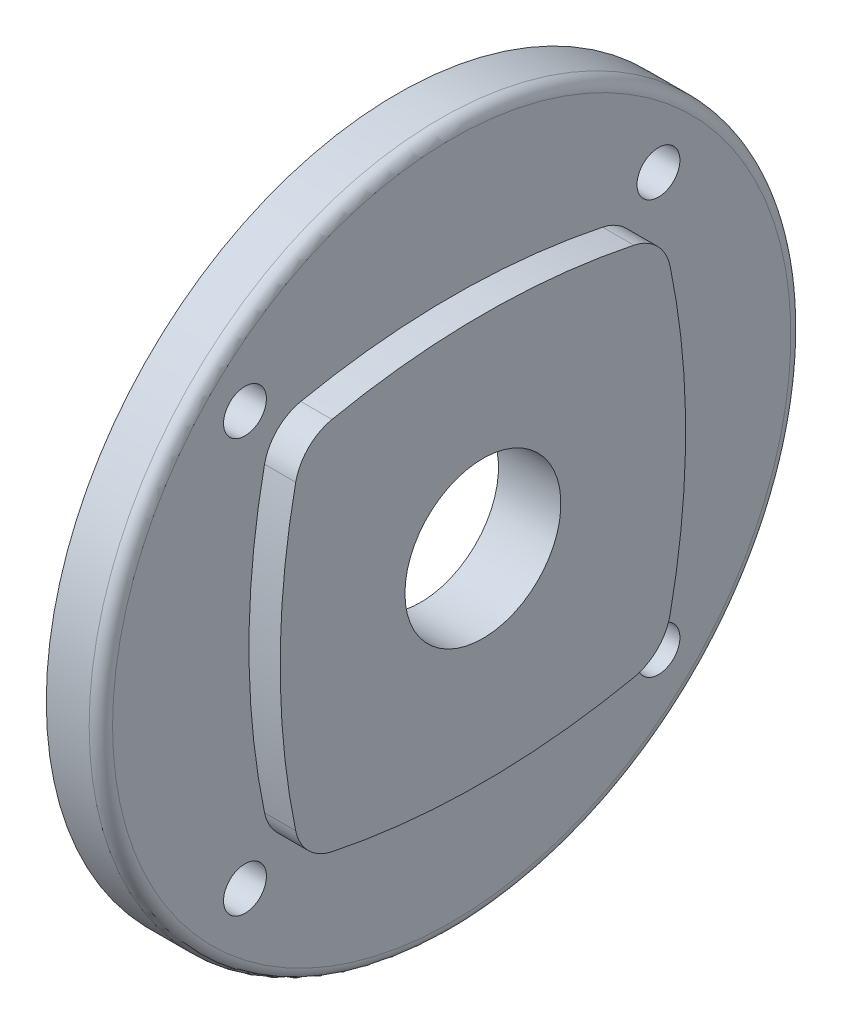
ISO-10303-21;
HEADER;
FILE_DESCRIPTION(('STEP AP214'),'2;1');
FILE_NAME('part.step','',(''),(''),'','','');
FILE_SCHEMA(('AUTOMOTIVE_DESIGN { 1 0 10303 214 1 1 1 1 }'));
ENDSEC;
DATA;
#1=APPLICATION_CONTEXT('core data for automotive mechanical design processes');
#2=APPLICATION_PROTOCOL_DEFINITION('international standard','automotive_design',2000,#1);
#3=PRODUCT_CONTEXT('',#1,'mechanical');
#4=PRODUCT('Part','Part','',(#3));
#5=PRODUCT_RELATED_PRODUCT_CATEGORY('part','',(#4));
#6=PRODUCT_DEFINITION_FORMATION('','',#4);
#7=PRODUCT_DEFINITION_CONTEXT('part definition',#1,'design');
#8=PRODUCT_DEFINITION('design','',#6,#7);
#9=PRODUCT_DEFINITION_SHAPE('','',#8);
#10=(LENGTH_UNIT() NAMED_UNIT(*) SI_UNIT(.MILLI.,.METRE.));
#11=(NAMED_UNIT(*) PLANE_ANGLE_UNIT() SI_UNIT($,.RADIAN.));
#12=(NAMED_UNIT(*) SI_UNIT($,.STERADIAN.) SOLID_ANGLE_UNIT());
#13=UNCERTAINTY_MEASURE_WITH_UNIT(LENGTH_MEASURE(1.E-05),#10,'distance_accuracy_value','');
#14=(GEOMETRIC_REPRESENTATION_CONTEXT(3) GLOBAL_UNCERTAINTY_ASSIGNED_CONTEXT((#13)) GLOBAL_UNIT_ASSIGNED_CONTEXT((#10,
#11,#12)) REPRESENTATION_CONTEXT('',''));
#15=CARTESIAN_POINT('',(0.,0.,0.));
#16=DIRECTION('',(0.,0.,1.));
#17=DIRECTION('',(1.,0.,0.));
#18=AXIS2_PLACEMENT_3D('',#15,#16,#17);
#19=CARTESIAN_POINT('',(11.,0.,0.));
#20=DIRECTION('',(-1.,0.,0.));
#21=DIRECTION('',(0.,0.,1.));
#22=AXIS2_PLACEMENT_3D('',#19,#20,#21);
#23=CYLINDRICAL_SURFACE('',#22,10.);
#24=CARTESIAN_POINT('',(11.,0.,0.));
#25=DIRECTION('',(-1.,0.,0.));
#26=DIRECTION('',(0.,0.,1.));
#27=AXIS2_PLACEMENT_3D('',#24,#25,#26);
#28=CIRCLE('',#27,10.);
#29=CARTESIAN_POINT('',(11.,0.,10.));
#30=VERTEX_POINT('',#29);
#31=EDGE_CURVE('E20',#30,#30,#28,.F.);
#32=ORIENTED_EDGE('',*,*,#31,.T.);
#33=EDGE_LOOP('',(#32));
#34=FACE_BOUND('',#33,.T.);
#35=CARTESIAN_POINT('',(3.,0.,0.));
#36=DIRECTION('',(-1.,0.,0.));
#37=DIRECTION('',(0.,0.,1.));
#38=AXIS2_PLACEMENT_3D('',#35,#36,#37);
#39=CIRCLE('',#38,10.);
#40=CARTESIAN_POINT('',(3.,0.,10.));
#41=VERTEX_POINT('',#40);
#42=EDGE_CURVE('E91',#41,#41,#39,.T.);
#43=ORIENTED_EDGE('',*,*,#42,.T.);
#44=EDGE_LOOP('',(#43));
#45=FACE_BOUND('',#44,.T.);
#46=ADVANCED_FACE('F16',(#34,#45),#23,.F.);
#47=CARTESIAN_POINT('',(11.,-26.312,-26.312));
#48=DIRECTION('',(-1.,0.,0.));
#49=DIRECTION('',(0.,0.,1.));
#50=AXIS2_PLACEMENT_3D('',#47,#48,#49);
#51=PLANE('',#50);
#52=ORIENTED_EDGE('',*,*,#31,.F.);
#53=EDGE_LOOP('',(#52));
#54=FACE_BOUND('',#53,.T.);
#55=CARTESIAN_POINT('',(11.,-18.1331644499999,-18.1331644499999));
#56=DIRECTION('',(1.,0.,0.));
#57=DIRECTION('',(0.,1.,0.));
#58=AXIS2_PLACEMENT_3D('',#55,#56,#57);
#59=CIRCLE('',#58,6.);
#60=CARTESIAN_POINT('',(11.,-24.0073103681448,-19.3556249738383));
#61=VERTEX_POINT('',#60);
#62=CARTESIAN_POINT('',(11.,-19.3556249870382,-24.0073103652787));
#63=VERTEX_POINT('',#62);
#64=EDGE_CURVE('E114',#61,#63,#59,.T.);
#65=ORIENTED_EDGE('',*,*,#64,.T.);
#66=CARTESIAN_POINT('',(11.,0.,69.));
#67=DIRECTION('',(1.,0.,0.));
#68=DIRECTION('',(0.,1.,0.));
#69=AXIS2_PLACEMENT_3D('',#66,#67,#68);
#70=CIRCLE('',#69,95.);
#71=CARTESIAN_POINT('',(11.,19.3556249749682,-24.0073103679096));
#72=VERTEX_POINT('',#71);
#73=EDGE_CURVE('E101',#63,#72,#70,.T.);
#74=ORIENTED_EDGE('',*,*,#73,.T.);
#75=CARTESIAN_POINT('',(11.,18.13316445,-18.1331644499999));
#76=DIRECTION('',(1.,0.,0.));
#77=DIRECTION('',(0.,1.,0.));
#78=AXIS2_PLACEMENT_3D('',#75,#76,#77);
#79=CIRCLE('',#78,6.);
#80=CARTESIAN_POINT('',(11.,24.0073103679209,-19.355624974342));
#81=VERTEX_POINT('',#80);
#82=EDGE_CURVE('E94',#72,#81,#79,.T.);
#83=ORIENTED_EDGE('',*,*,#82,.T.);
#84=CARTESIAN_POINT('',(11.,-69.,0.));
#85=DIRECTION('',(1.,0.,0.));
#86=DIRECTION('',(0.,1.,0.));
#87=AXIS2_PLACEMENT_3D('',#84,#85,#86);
#88=CIRCLE('',#87,95.);
#89=CARTESIAN_POINT('',(11.,24.0073103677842,19.3556249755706));
#90=VERTEX_POINT('',#89);
#91=EDGE_CURVE('E81',#81,#90,#88,.T.);
#92=ORIENTED_EDGE('',*,*,#91,.T.);
#93=CARTESIAN_POINT('',(11.,18.1331644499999,18.13316445));
#94=DIRECTION('',(1.,0.,0.));
#95=DIRECTION('',(0.,1.,0.));
#96=AXIS2_PLACEMENT_3D('',#93,#94,#95);
#97=CIRCLE('',#96,6.);
#98=CARTESIAN_POINT('',(11.,19.3556249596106,24.0073103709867));
#99=VERTEX_POINT('',#98);
#100=EDGE_CURVE('E90',#90,#99,#97,.T.);
#101=ORIENTED_EDGE('',*,*,#100,.T.);
#102=CARTESIAN_POINT('',(11.,0.,-69.));
#103=DIRECTION('',(1.,0.,0.));
#104=DIRECTION('',(0.,1.,0.));
#105=AXIS2_PLACEMENT_3D('',#102,#103,#104);
#106=CIRCLE('',#105,95.);
#107=CARTESIAN_POINT('',(11.,-19.355624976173,24.007310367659));
#108=VERTEX_POINT('',#107);
#109=EDGE_CURVE('E127',#99,#108,#106,.T.);
#110=ORIENTED_EDGE('',*,*,#109,.T.);
#111=CARTESIAN_POINT('',(11.,-18.13316445,18.1331644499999));
#112=DIRECTION('',(1.,0.,0.));
#113=DIRECTION('',(0.,1.,0.));
#114=AXIS2_PLACEMENT_3D('',#111,#112,#113);
#115=CIRCLE('',#114,6.);
#116=CARTESIAN_POINT('',(11.,-24.0073103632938,19.3556249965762));
#117=VERTEX_POINT('',#116);
#118=EDGE_CURVE('E123',#108,#117,#115,.T.);
#119=ORIENTED_EDGE('',*,*,#118,.T.);
#120=CARTESIAN_POINT('',(11.,69.,0.));
#121=DIRECTION('',(1.,0.,0.));
#122=DIRECTION('',(0.,1.,0.));
#123=AXIS2_PLACEMENT_3D('',#120,#121,#122);
#124=CIRCLE('',#123,95.);
#125=EDGE_CURVE('E118',#117,#61,#124,.T.);
#126=ORIENTED_EDGE('',*,*,#125,.T.);
#127=EDGE_LOOP('',(#65,#74,#83,#92,#101,#110,#119,#126));
#128=FACE_BOUND('',#127,.T.);
#129=ADVANCED_FACE('F100',(#54,#128),#51,.F.);
#130=CARTESIAN_POINT('',(3.,-30.36,30.36));
#131=DIRECTION('',(1.,0.,0.));
#132=DIRECTION('',(0.,0.,-1.));
#133=AXIS2_PLACEMENT_3D('',#130,#131,#132);
#134=PLANE('',#133);
#135=ORIENTED_EDGE('',*,*,#42,.F.);
#136=EDGE_LOOP('',(#135));
#137=FACE_BOUND('',#136,.T.);
#138=CARTESIAN_POINT('',(3.,0.,0.));
#139=DIRECTION('',(-1.,0.,0.));
#140=DIRECTION('',(0.,0.,1.));
#141=AXIS2_PLACEMENT_3D('',#138,#139,#140);
#142=CIRCLE('',#141,30.);
#143=CARTESIAN_POINT('',(3.,0.,30.));
#144=VERTEX_POINT('',#143);
#145=EDGE_CURVE('E111',#144,#144,#142,.F.);
#146=ORIENTED_EDGE('',*,*,#145,.F.);
#147=EDGE_LOOP('',(#146));
#148=FACE_BOUND('',#147,.T.);
#149=ADVANCED_FACE('F145',(#137,#148),#134,.F.);
#150=CARTESIAN_POINT('',(5.5,0.,0.));
#151=DIRECTION('',(-1.,0.,0.));
#152=DIRECTION('',(0.,0.,1.));
#153=AXIS2_PLACEMENT_3D('',#150,#151,#152);
#154=TOROIDAL_SURFACE('',#153,43.5,1.5);
#155=CARTESIAN_POINT('',(5.5,0.,0.));
#156=DIRECTION('',(-1.,0.,0.));
#157=DIRECTION('',(0.,0.,1.));
#158=AXIS2_PLACEMENT_3D('',#155,#156,#157);
#159=CIRCLE('',#158,45.);
#160=CARTESIAN_POINT('',(5.5,0.,45.));
#161=VERTEX_POINT('',#160);
#162=EDGE_CURVE('E256',#161,#161,#159,.F.);
#163=ORIENTED_EDGE('',*,*,#162,.T.);
#164=EDGE_LOOP('',(#163));
#165=FACE_BOUND('',#164,.T.);
#166=CARTESIAN_POINT('',(7.,0.,0.));
#167=DIRECTION('',(-1.,0.,0.));
#168=DIRECTION('',(0.,0.,1.));
#169=AXIS2_PLACEMENT_3D('',#166,#167,#168);
#170=CIRCLE('',#169,43.499999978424);
#171=CARTESIAN_POINT('',(7.,0.,43.499999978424));
#172=VERTEX_POINT('',#171);
#173=EDGE_CURVE('E249',#172,#172,#170,.T.);
#174=ORIENTED_EDGE('',*,*,#173,.T.);
#175=EDGE_LOOP('',(#174));
#176=FACE_BOUND('',#175,.T.);
#177=ADVANCED_FACE('F152',(#165,#176),#154,.T.);
#178=CARTESIAN_POINT('',(7.,-69.,0.));
#179=DIRECTION('',(1.,0.,0.));
#180=DIRECTION('',(0.,1.,0.));
#181=AXIS2_PLACEMENT_3D('',#178,#179,#180);
#182=CYLINDRICAL_SURFACE('',#181,95.);
#183=ORIENTED_EDGE('',*,*,#91,.F.);
#184=DIRECTION('',(1.,0.,0.));
#185=VECTOR('',#184,1.);
#186=CARTESIAN_POINT('',(9.,24.0073103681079,-19.3556249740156));
#187=LINE('',#186,#185);
#188=CARTESIAN_POINT('',(7.,24.0073103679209,-19.355624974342));
#189=VERTEX_POINT('',#188);
#190=EDGE_CURVE('E85',#81,#189,#187,.F.);
#191=ORIENTED_EDGE('',*,*,#190,.T.);
#192=CARTESIAN_POINT('',(7.,-69.,0.));
#193=DIRECTION('',(1.,0.,0.));
#194=DIRECTION('',(0.,1.,0.));
#195=AXIS2_PLACEMENT_3D('',#192,#193,#194);
#196=CIRCLE('',#195,95.);
#197=CARTESIAN_POINT('',(7.,24.0073103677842,19.3556249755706));
#198=VERTEX_POINT('',#197);
#199=EDGE_CURVE('E262',#189,#198,#196,.T.);
#200=ORIENTED_EDGE('',*,*,#199,.T.);
#201=DIRECTION('',(-1.,0.,0.));
#202=VECTOR('',#201,1.);
#203=CARTESIAN_POINT('',(9.,24.0073103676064,19.3556249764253));
#204=LINE('',#203,#202);
#205=EDGE_CURVE('E86',#198,#90,#204,.F.);
#206=ORIENTED_EDGE('',*,*,#205,.T.);
#207=EDGE_LOOP('',(#183,#191,#200,#206));
#208=FACE_BOUND('',#207,.T.);
#209=ADVANCED_FACE('F83',(#208),#182,.T.);
#210=CARTESIAN_POINT('',(7.,18.1331644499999,18.13316445));
#211=DIRECTION('',(1.,0.,0.));
#212=DIRECTION('',(0.,1.,0.));
#213=AXIS2_PLACEMENT_3D('',#210,#211,#212);
#214=CYLINDRICAL_SURFACE('',#213,6.);
#215=CARTESIAN_POINT('',(7.,18.1331644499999,18.13316445));
#216=DIRECTION('',(1.,0.,0.));
#217=DIRECTION('',(0.,1.,0.));
#218=AXIS2_PLACEMENT_3D('',#215,#216,#217);
#219=CIRCLE('',#218,6.);
#220=CARTESIAN_POINT('',(7.,19.3556249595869,24.0073103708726));
#221=VERTEX_POINT('',#220);
#222=EDGE_CURVE('E264',#198,#221,#219,.T.);
#223=ORIENTED_EDGE('',*,*,#222,.T.);
#224=DIRECTION('',(-1.,0.,0.));
#225=VECTOR('',#224,1.);
#226=CARTESIAN_POINT('',(9.,19.3556249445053,24.0073103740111));
#227=LINE('',#226,#225);
#228=EDGE_CURVE('E131',#221,#99,#227,.F.);
#229=ORIENTED_EDGE('',*,*,#228,.T.);
#230=ORIENTED_EDGE('',*,*,#100,.F.);
#231=ORIENTED_EDGE('',*,*,#205,.F.);
#232=EDGE_LOOP('',(#223,#229,#230,#231));
#233=FACE_BOUND('',#232,.T.);
#234=ADVANCED_FACE('F208',(#233),#214,.T.);
#235=CARTESIAN_POINT('',(7.,0.,-69.));
#236=DIRECTION('',(1.,0.,0.));
#237=DIRECTION('',(0.,1.,0.));
#238=AXIS2_PLACEMENT_3D('',#235,#236,#237);
#239=CYLINDRICAL_SURFACE('',#238,95.);
#240=ORIENTED_EDGE('',*,*,#109,.F.);
#241=ORIENTED_EDGE('',*,*,#228,.F.);
#242=CARTESIAN_POINT('',(7.,0.,-69.));
#243=DIRECTION('',(1.,0.,0.));
#244=DIRECTION('',(0.,1.,0.));
#245=AXIS2_PLACEMENT_3D('',#242,#243,#244);
#246=CIRCLE('',#245,95.);
#247=CARTESIAN_POINT('',(7.,-19.355624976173,24.007310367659));
#248=VERTEX_POINT('',#247);
#249=EDGE_CURVE('E268',#221,#248,#246,.T.);
#250=ORIENTED_EDGE('',*,*,#249,.T.);
#251=DIRECTION('',(-1.,0.,0.));
#252=VECTOR('',#251,1.);
#253=CARTESIAN_POINT('',(9.,-19.35562497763,24.0073103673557));
#254=LINE('',#253,#252);
#255=EDGE_CURVE('E126',#248,#108,#254,.F.);
#256=ORIENTED_EDGE('',*,*,#255,.T.);
#257=EDGE_LOOP('',(#240,#241,#250,#256));
#258=FACE_BOUND('',#257,.T.);
#259=ADVANCED_FACE('F204',(#258),#239,.T.);
#260=CARTESIAN_POINT('',(7.,-18.13316445,18.1331644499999));
#261=DIRECTION('',(1.,0.,0.));
#262=DIRECTION('',(0.,1.,0.));
#263=AXIS2_PLACEMENT_3D('',#260,#261,#262);
#264=CYLINDRICAL_SURFACE('',#263,6.);
#265=CARTESIAN_POINT('',(7.,-18.13316445,18.1331644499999));
#266=DIRECTION('',(1.,0.,0.));
#267=DIRECTION('',(0.,1.,0.));
#268=AXIS2_PLACEMENT_3D('',#265,#266,#267);
#269=CIRCLE('',#268,6.);
#270=CARTESIAN_POINT('',(7.,-24.0073103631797,19.3556249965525));
#271=VERTEX_POINT('',#270);
#272=EDGE_CURVE('E271',#248,#271,#269,.T.);
#273=ORIENTED_EDGE('',*,*,#272,.T.);
#274=DIRECTION('',(-1.,0.,0.));
#275=VECTOR('',#274,1.);
#276=CARTESIAN_POINT('',(9.,-24.0073103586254,19.3556250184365));
#277=LINE('',#276,#275);
#278=EDGE_CURVE('E122',#271,#117,#277,.F.);
#279=ORIENTED_EDGE('',*,*,#278,.T.);
#280=ORIENTED_EDGE('',*,*,#118,.F.);
#281=ORIENTED_EDGE('',*,*,#255,.F.);
#282=EDGE_LOOP('',(#273,#279,#280,#281));
#283=FACE_BOUND('',#282,.T.);
#284=ADVANCED_FACE('F200',(#283),#264,.T.);
#285=CARTESIAN_POINT('',(7.,69.,0.));
#286=DIRECTION('',(1.,0.,0.));
#287=DIRECTION('',(0.,1.,0.));
#288=AXIS2_PLACEMENT_3D('',#285,#286,#287);
#289=CYLINDRICAL_SURFACE('',#288,95.);
#290=ORIENTED_EDGE('',*,*,#125,.F.);
#291=ORIENTED_EDGE('',*,*,#278,.F.);
#292=CARTESIAN_POINT('',(7.,69.,0.));
#293=DIRECTION('',(1.,0.,0.));
#294=DIRECTION('',(0.,1.,0.));
#295=AXIS2_PLACEMENT_3D('',#292,#293,#294);
#296=CIRCLE('',#295,95.);
#297=CARTESIAN_POINT('',(7.,-24.0073103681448,-19.3556249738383));
#298=VERTEX_POINT('',#297);
#299=EDGE_CURVE('E275',#271,#298,#296,.T.);
#300=ORIENTED_EDGE('',*,*,#299,.T.);
#301=DIRECTION('',(-1.,0.,0.));
#302=VECTOR('',#301,1.);
#303=CARTESIAN_POINT('',(9.,-24.0073103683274,-19.3556249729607));
#304=LINE('',#303,#302);
#305=EDGE_CURVE('E117',#298,#61,#304,.F.);
#306=ORIENTED_EDGE('',*,*,#305,.T.);
#307=EDGE_LOOP('',(#290,#291,#300,#306));
#308=FACE_BOUND('',#307,.T.);
#309=ADVANCED_FACE('F196',(#308),#289,.T.);
#310=CARTESIAN_POINT('',(7.,-18.1331644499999,-18.1331644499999));
#311=DIRECTION('',(1.,0.,0.));
#312=DIRECTION('',(0.,1.,0.));
#313=AXIS2_PLACEMENT_3D('',#310,#311,#312);
#314=CYLINDRICAL_SURFACE('',#313,6.);
#315=CARTESIAN_POINT('',(7.,-18.1331644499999,-18.1331644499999));
#316=DIRECTION('',(1.,0.,0.));
#317=DIRECTION('',(0.,1.,0.));
#318=AXIS2_PLACEMENT_3D('',#315,#316,#317);
#319=CIRCLE('',#318,6.);
#320=CARTESIAN_POINT('',(7.,-19.3556249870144,-24.0073103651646));
#321=VERTEX_POINT('',#320);
#322=EDGE_CURVE('E279',#298,#321,#319,.T.);
#323=ORIENTED_EDGE('',*,*,#322,.T.);
#324=DIRECTION('',(-1.,0.,0.));
#325=VECTOR('',#324,1.);
#326=CARTESIAN_POINT('',(9.,-19.3556249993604,-24.0073103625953));
#327=LINE('',#326,#325);
#328=EDGE_CURVE('E108',#321,#63,#327,.F.);
#329=ORIENTED_EDGE('',*,*,#328,.T.);
#330=ORIENTED_EDGE('',*,*,#64,.F.);
#331=ORIENTED_EDGE('',*,*,#305,.F.);
#332=EDGE_LOOP('',(#323,#329,#330,#331));
#333=FACE_BOUND('',#332,.T.);
#334=ADVANCED_FACE('F192',(#333),#314,.T.);
#335=CARTESIAN_POINT('',(7.,0.,69.));
#336=DIRECTION('',(1.,0.,0.));
#337=DIRECTION('',(0.,1.,0.));
#338=AXIS2_PLACEMENT_3D('',#335,#336,#337);
#339=CYLINDRICAL_SURFACE('',#338,95.);
#340=CARTESIAN_POINT('',(7.,0.,69.));
#341=DIRECTION('',(1.,0.,0.));
#342=DIRECTION('',(0.,1.,0.));
#343=AXIS2_PLACEMENT_3D('',#340,#341,#342);
#344=CIRCLE('',#343,95.);
#345=CARTESIAN_POINT('',(7.,19.3556249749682,-24.0073103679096));
#346=VERTEX_POINT('',#345);
#347=EDGE_CURVE('E230',#321,#346,#344,.T.);
#348=ORIENTED_EDGE('',*,*,#347,.T.);
#349=DIRECTION('',(-1.,0.,0.));
#350=VECTOR('',#349,1.);
#351=CARTESIAN_POINT('',(9.,19.3556249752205,-24.0073103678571));
#352=LINE('',#351,#350);
#353=EDGE_CURVE('E36',#346,#72,#352,.F.);
#354=ORIENTED_EDGE('',*,*,#353,.T.);
#355=ORIENTED_EDGE('',*,*,#73,.F.);
#356=ORIENTED_EDGE('',*,*,#328,.F.);
#357=EDGE_LOOP('',(#348,#354,#355,#356));
#358=FACE_BOUND('',#357,.T.);
#359=ADVANCED_FACE('F189',(#358),#339,.T.);
#360=CARTESIAN_POINT('',(7.,18.13316445,-18.1331644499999));
#361=DIRECTION('',(1.,0.,0.));
#362=DIRECTION('',(0.,1.,0.));
#363=AXIS2_PLACEMENT_3D('',#360,#361,#362);
#364=CYLINDRICAL_SURFACE('',#363,6.);
#365=CARTESIAN_POINT('',(7.,18.13316445,-18.1331644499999));
#366=DIRECTION('',(1.,0.,0.));
#367=DIRECTION('',(0.,1.,0.));
#368=AXIS2_PLACEMENT_3D('',#365,#366,#367);
#369=CIRCLE('',#368,6.);
#370=EDGE_CURVE('E96',#346,#189,#369,.T.);
#371=ORIENTED_EDGE('',*,*,#370,.T.);
#372=ORIENTED_EDGE('',*,*,#190,.F.);
#373=ORIENTED_EDGE('',*,*,#82,.F.);
#374=ORIENTED_EDGE('',*,*,#353,.F.);
#375=EDGE_LOOP('',(#371,#372,#373,#374));
#376=FACE_BOUND('',#375,.T.);
#377=ADVANCED_FACE('F93',(#376),#364,.T.);
#378=CARTESIAN_POINT('',(5.5,0.,0.));
#379=DIRECTION('',(-1.,0.,0.));
#380=DIRECTION('',(0.,0.,1.));
#381=AXIS2_PLACEMENT_3D('',#378,#379,#380);
#382=CYLINDRICAL_SURFACE('',#381,45.);
#383=CARTESIAN_POINT('',(0.,0.,0.));
#384=DIRECTION('',(-1.,0.,0.));
#385=DIRECTION('',(0.,0.,1.));
#386=AXIS2_PLACEMENT_3D('',#383,#384,#385);
#387=CIRCLE('',#386,45.);
#388=CARTESIAN_POINT('',(0.,0.,45.));
#389=VERTEX_POINT('',#388);
#390=EDGE_CURVE('E286',#389,#389,#387,.F.);
#391=ORIENTED_EDGE('',*,*,#390,.T.);
#392=EDGE_LOOP('',(#391));
#393=FACE_BOUND('',#392,.T.);
#394=ORIENTED_EDGE('',*,*,#162,.F.);
#395=EDGE_LOOP('',(#394));
#396=FACE_BOUND('',#395,.T.);
#397=ADVANCED_FACE('F182',(#393,#396),#382,.T.);
#398=CARTESIAN_POINT('',(7.,-26.516504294,26.516504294));
#399=DIRECTION('',(-1.,0.,0.));
#400=DIRECTION('',(0.,-1.,0.));
#401=AXIS2_PLACEMENT_3D('',#398,#399,#400);
#402=CYLINDRICAL_SURFACE('',#401,2.75);
#403=CARTESIAN_POINT('',(7.,-26.516504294,26.516504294));
#404=DIRECTION('',(-1.,0.,0.));
#405=DIRECTION('',(0.,-1.,0.));
#406=AXIS2_PLACEMENT_3D('',#403,#404,#405);
#407=CIRCLE('',#406,2.75);
#408=CARTESIAN_POINT('',(7.,-29.266504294,26.516504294));
#409=VERTEX_POINT('',#408);
#410=EDGE_CURVE('E243',#409,#409,#407,.F.);
#411=ORIENTED_EDGE('',*,*,#410,.T.);
#412=EDGE_LOOP('',(#411));
#413=FACE_BOUND('',#412,.T.);
#414=CARTESIAN_POINT('',(0.,-26.516504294,26.516504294));
#415=DIRECTION('',(-1.,0.,0.));
#416=DIRECTION('',(0.,-1.,0.));
#417=AXIS2_PLACEMENT_3D('',#414,#415,#416);
#418=CIRCLE('',#417,2.75);
#419=CARTESIAN_POINT('',(0.,-29.266504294,26.516504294));
#420=VERTEX_POINT('',#419);
#421=EDGE_CURVE('E290',#420,#420,#418,.T.);
#422=ORIENTED_EDGE('',*,*,#421,.T.);
#423=EDGE_LOOP('',(#422));
#424=FACE_BOUND('',#423,.T.);
#425=ADVANCED_FACE('F178',(#413,#424),#402,.F.);
#426=CARTESIAN_POINT('',(7.,26.516504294,-26.516504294));
#427=DIRECTION('',(-1.,0.,0.));
#428=DIRECTION('',(0.,-1.,0.));
#429=AXIS2_PLACEMENT_3D('',#426,#427,#428);
#430=CYLINDRICAL_SURFACE('',#429,2.75);
#431=CARTESIAN_POINT('',(7.,26.516504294,-26.516504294));
#432=DIRECTION('',(-1.,0.,0.));
#433=DIRECTION('',(0.,-1.,0.));
#434=AXIS2_PLACEMENT_3D('',#431,#432,#433);
#435=CIRCLE('',#434,2.75);
#436=CARTESIAN_POINT('',(7.,23.766504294,-26.516504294));
#437=VERTEX_POINT('',#436);
#438=EDGE_CURVE('E239',#437,#437,#435,.F.);
#439=ORIENTED_EDGE('',*,*,#438,.T.);
#440=EDGE_LOOP('',(#439));
#441=FACE_BOUND('',#440,.T.);
#442=CARTESIAN_POINT('',(0.,26.516504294,-26.516504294));
#443=DIRECTION('',(-1.,0.,0.));
#444=DIRECTION('',(0.,-1.,0.));
#445=AXIS2_PLACEMENT_3D('',#442,#443,#444);
#446=CIRCLE('',#445,2.75);
#447=CARTESIAN_POINT('',(0.,23.766504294,-26.516504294));
#448=VERTEX_POINT('',#447);
#449=EDGE_CURVE('E294',#448,#448,#446,.T.);
#450=ORIENTED_EDGE('',*,*,#449,.T.);
#451=EDGE_LOOP('',(#450));
#452=FACE_BOUND('',#451,.T.);
#453=ADVANCED_FACE('F174',(#441,#452),#430,.F.);
#454=CARTESIAN_POINT('',(7.,26.516504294,26.516504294));
#455=DIRECTION('',(-1.,0.,0.));
#456=DIRECTION('',(0.,-1.,0.));
#457=AXIS2_PLACEMENT_3D('',#454,#455,#456);
#458=CYLINDRICAL_SURFACE('',#457,2.75);
#459=CARTESIAN_POINT('',(7.,26.516504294,26.516504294));
#460=DIRECTION('',(-1.,0.,0.));
#461=DIRECTION('',(0.,-1.,0.));
#462=AXIS2_PLACEMENT_3D('',#459,#460,#461);
#463=CIRCLE('',#462,2.75);
#464=CARTESIAN_POINT('',(7.,23.766504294,26.516504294));
#465=VERTEX_POINT('',#464);
#466=EDGE_CURVE('E235',#465,#465,#463,.F.);
#467=ORIENTED_EDGE('',*,*,#466,.T.);
#468=EDGE_LOOP('',(#467));
#469=FACE_BOUND('',#468,.T.);
#470=CARTESIAN_POINT('',(0.,26.516504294,26.516504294));
#471=DIRECTION('',(-1.,0.,0.));
#472=DIRECTION('',(0.,-1.,0.));
#473=AXIS2_PLACEMENT_3D('',#470,#471,#472);
#474=CIRCLE('',#473,2.75);
#475=CARTESIAN_POINT('',(0.,23.766504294,26.516504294));
#476=VERTEX_POINT('',#475);
#477=EDGE_CURVE('E298',#476,#476,#474,.T.);
#478=ORIENTED_EDGE('',*,*,#477,.T.);
#479=EDGE_LOOP('',(#478));
#480=FACE_BOUND('',#479,.T.);
#481=ADVANCED_FACE('F170',(#469,#480),#458,.F.);
#482=CARTESIAN_POINT('',(3.,0.,0.));
#483=DIRECTION('',(-1.,0.,0.));
#484=DIRECTION('',(0.,0.,1.));
#485=AXIS2_PLACEMENT_3D('',#482,#483,#484);
#486=CYLINDRICAL_SURFACE('',#485,30.);
#487=ORIENTED_EDGE('',*,*,#145,.T.);
#488=EDGE_LOOP('',(#487));
#489=FACE_BOUND('',#488,.T.);
#490=CARTESIAN_POINT('',(0.,0.,0.));
#491=DIRECTION('',(-1.,0.,0.));
#492=DIRECTION('',(0.,0.,1.));
#493=AXIS2_PLACEMENT_3D('',#490,#491,#492);
#494=CIRCLE('',#493,30.);
#495=CARTESIAN_POINT('',(0.,0.,30.));
#496=VERTEX_POINT('',#495);
#497=EDGE_CURVE('E302',#496,#496,#494,.T.);
#498=ORIENTED_EDGE('',*,*,#497,.T.);
#499=EDGE_LOOP('',(#498));
#500=FACE_BOUND('',#499,.T.);
#501=ADVANCED_FACE('F167',(#489,#500),#486,.F.);
#502=CARTESIAN_POINT('',(7.,-44.022,-44.022));
#503=DIRECTION('',(-1.,0.,0.));
#504=DIRECTION('',(0.,0.,1.));
#505=AXIS2_PLACEMENT_3D('',#502,#503,#504);
#506=PLANE('',#505);
#507=ORIENTED_EDGE('',*,*,#347,.F.);
#508=ORIENTED_EDGE('',*,*,#322,.F.);
#509=ORIENTED_EDGE('',*,*,#299,.F.);
#510=ORIENTED_EDGE('',*,*,#272,.F.);
#511=ORIENTED_EDGE('',*,*,#249,.F.);
#512=ORIENTED_EDGE('',*,*,#222,.F.);
#513=ORIENTED_EDGE('',*,*,#199,.F.);
#514=ORIENTED_EDGE('',*,*,#370,.F.);
#515=EDGE_LOOP('',(#507,#508,#509,#510,#511,#512,#513,#514));
#516=FACE_BOUND('',#515,.T.);
#517=ORIENTED_EDGE('',*,*,#466,.F.);
#518=EDGE_LOOP('',(#517));
#519=FACE_BOUND('',#518,.T.);
#520=ORIENTED_EDGE('',*,*,#438,.F.);
#521=EDGE_LOOP('',(#520));
#522=FACE_BOUND('',#521,.T.);
#523=ORIENTED_EDGE('',*,*,#410,.F.);
#524=EDGE_LOOP('',(#523));
#525=FACE_BOUND('',#524,.T.);
#526=CARTESIAN_POINT('',(7.,-26.516504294,-26.516504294));
#527=DIRECTION('',(-1.,0.,0.));
#528=DIRECTION('',(0.,-1.,0.));
#529=AXIS2_PLACEMENT_3D('',#526,#527,#528);
#530=CIRCLE('',#529,2.75);
#531=CARTESIAN_POINT('',(7.,-29.266504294,-26.516504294));
#532=VERTEX_POINT('',#531);
#533=EDGE_CURVE('E27',#532,#532,#530,.F.);
#534=ORIENTED_EDGE('',*,*,#533,.F.);
#535=EDGE_LOOP('',(#534));
#536=FACE_BOUND('',#535,.T.);
#537=ORIENTED_EDGE('',*,*,#173,.F.);
#538=EDGE_LOOP('',(#537));
#539=FACE_BOUND('',#538,.T.);
#540=ADVANCED_FACE('F163',(#516,#519,#522,#525,#536,#539),#506,.F.);
#541=CARTESIAN_POINT('',(0.,-45.54,45.54));
#542=DIRECTION('',(1.,0.,0.));
#543=DIRECTION('',(0.,0.,-1.));
#544=AXIS2_PLACEMENT_3D('',#541,#542,#543);
#545=PLANE('',#544);
#546=ORIENTED_EDGE('',*,*,#497,.F.);
#547=EDGE_LOOP('',(#546));
#548=FACE_BOUND('',#547,.T.);
#549=ORIENTED_EDGE('',*,*,#477,.F.);
#550=EDGE_LOOP('',(#549));
#551=FACE_BOUND('',#550,.T.);
#552=ORIENTED_EDGE('',*,*,#449,.F.);
#553=EDGE_LOOP('',(#552));
#554=FACE_BOUND('',#553,.T.);
#555=ORIENTED_EDGE('',*,*,#421,.F.);
#556=EDGE_LOOP('',(#555));
#557=FACE_BOUND('',#556,.T.);
#558=CARTESIAN_POINT('',(0.,-26.516504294,-26.516504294));
#559=DIRECTION('',(-1.,0.,0.));
#560=DIRECTION('',(0.,-1.,0.));
#561=AXIS2_PLACEMENT_3D('',#558,#559,#560);
#562=CIRCLE('',#561,2.75);
#563=CARTESIAN_POINT('',(0.,-29.2665042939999,-26.516504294));
#564=VERTEX_POINT('',#563);
#565=EDGE_CURVE('E11',#564,#564,#562,.T.);
#566=ORIENTED_EDGE('',*,*,#565,.F.);
#567=EDGE_LOOP('',(#566));
#568=FACE_BOUND('',#567,.T.);
#569=ORIENTED_EDGE('',*,*,#390,.F.);
#570=EDGE_LOOP('',(#569));
#571=FACE_BOUND('',#570,.T.);
#572=ADVANCED_FACE('F18',(#548,#551,#554,#557,#568,#571),#545,.F.);
#573=CARTESIAN_POINT('',(7.,-26.516504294,-26.516504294));
#574=DIRECTION('',(-1.,0.,0.));
#575=DIRECTION('',(0.,-1.,0.));
#576=AXIS2_PLACEMENT_3D('',#573,#574,#575);
#577=CYLINDRICAL_SURFACE('',#576,2.75);
#578=ORIENTED_EDGE('',*,*,#565,.T.);
#579=EDGE_LOOP('',(#578));
#580=FACE_BOUND('',#579,.T.);
#581=ORIENTED_EDGE('',*,*,#533,.T.);
#582=EDGE_LOOP('',(#581));
#583=FACE_BOUND('',#582,.T.);
#584=ADVANCED_FACE('F157',(#580,#583),#577,.F.);
#585=CLOSED_SHELL('',(#46,#129,#149,#177,#209,#234,#259,#284,#309,#334,#359,#377,#397,#425,#453,
#481,#501,#540,#572,#584));
#586=MANIFOLD_SOLID_BREP('B1',#585);
#587=ADVANCED_BREP_SHAPE_REPRESENTATION('',(#18,#586),#14);
#588=SHAPE_DEFINITION_REPRESENTATION(#9,#587);
ENDSEC;
END-ISO-10303-21;
